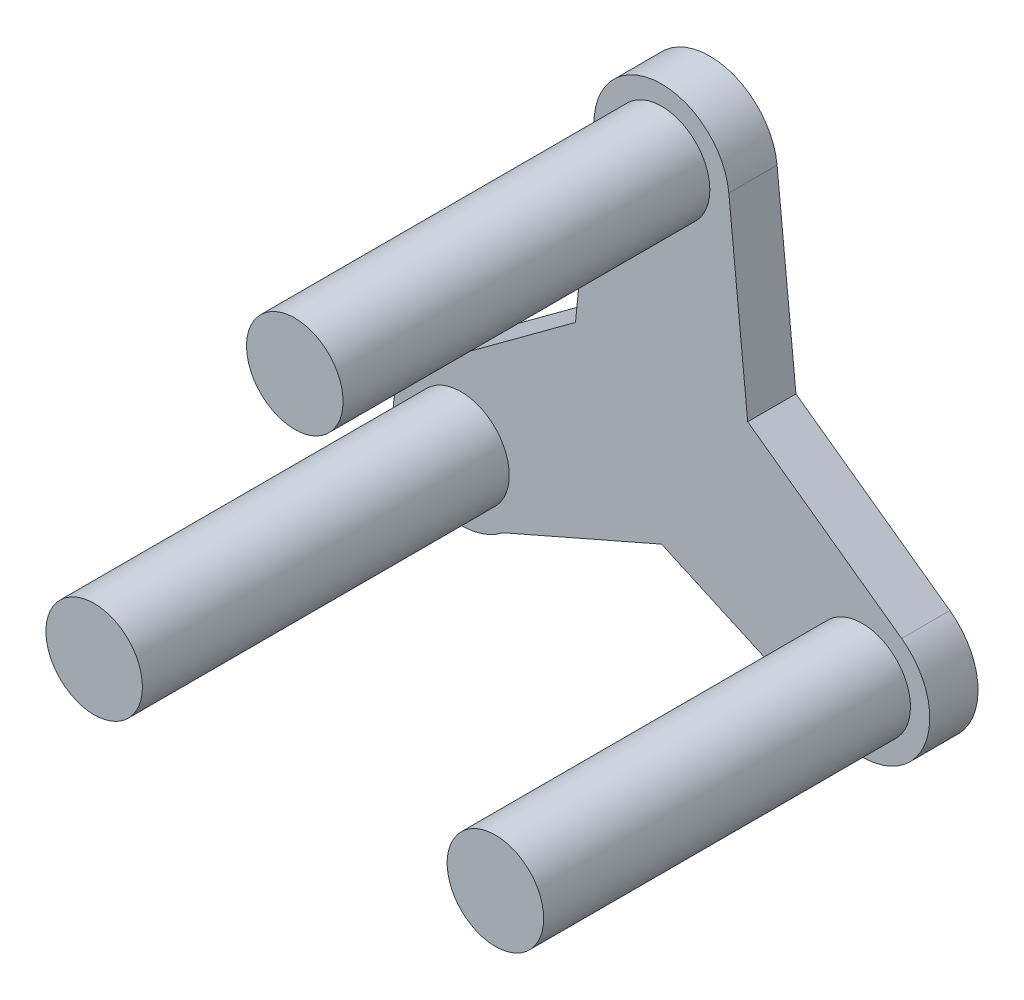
from build123d import *

# Parameters (mm, degrees)
ESTRUSIONE_ESTRUSIONE1_DEPTH = 2.5
SCHIZZO2_R                   = 2.5
ESTRUSIONE_ESTRUSIONE2_DEPTH = 19


with BuildPart() as part:
    # Schizzo1 → Estrusione-Estrusione1 (new body)
    with BuildSketch(Plane.XY):
        with BuildLine():
            Line((-4.461004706, 2.569215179), (-11.681562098, -2.746107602))
            ThreePointArc((-11.681562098, -2.746107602), (-13.423393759, -7.75), (-8.218979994, -8.743475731))
            Line((-8.218979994, -8.743475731), (-0.005496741, -5.147950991))
            Line((-0.005496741, -5.147950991), (8.952746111, -9.190246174))
            ThreePointArc((8.952746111, -9.190246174), (13.423393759, -7.75), (12.435359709, -3.158182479))
            Line((12.435359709, -3.158182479), (4.46040437, 2.575215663))
            Line((4.46040437, 2.575215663), (3.482613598, 12.348428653))
            ThreePointArc((3.482613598, 12.348428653), (0, 15.5), (-3.482613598, 12.348428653))
            Line((-3.482613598, 12.348428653), (-4.461004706, 2.569215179))
        make_face()
    extrude(amount=ESTRUSIONE_ESTRUSIONE1_DEPTH)

    # Schizzo2 → Estrusione-Estrusione2 (add)
    with BuildSketch(Plane.XY.offset(2.5)):
        with Locations((0, 12)):
            Circle(SCHIZZO2_R)
        with Locations((10.392304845, -6)):
            Circle(SCHIZZO2_R)
        with Locations((-10.392304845, -6)):
            Circle(SCHIZZO2_R)
    extrude(amount=ESTRUSIONE_ESTRUSIONE2_DEPTH)


solid = part.part
